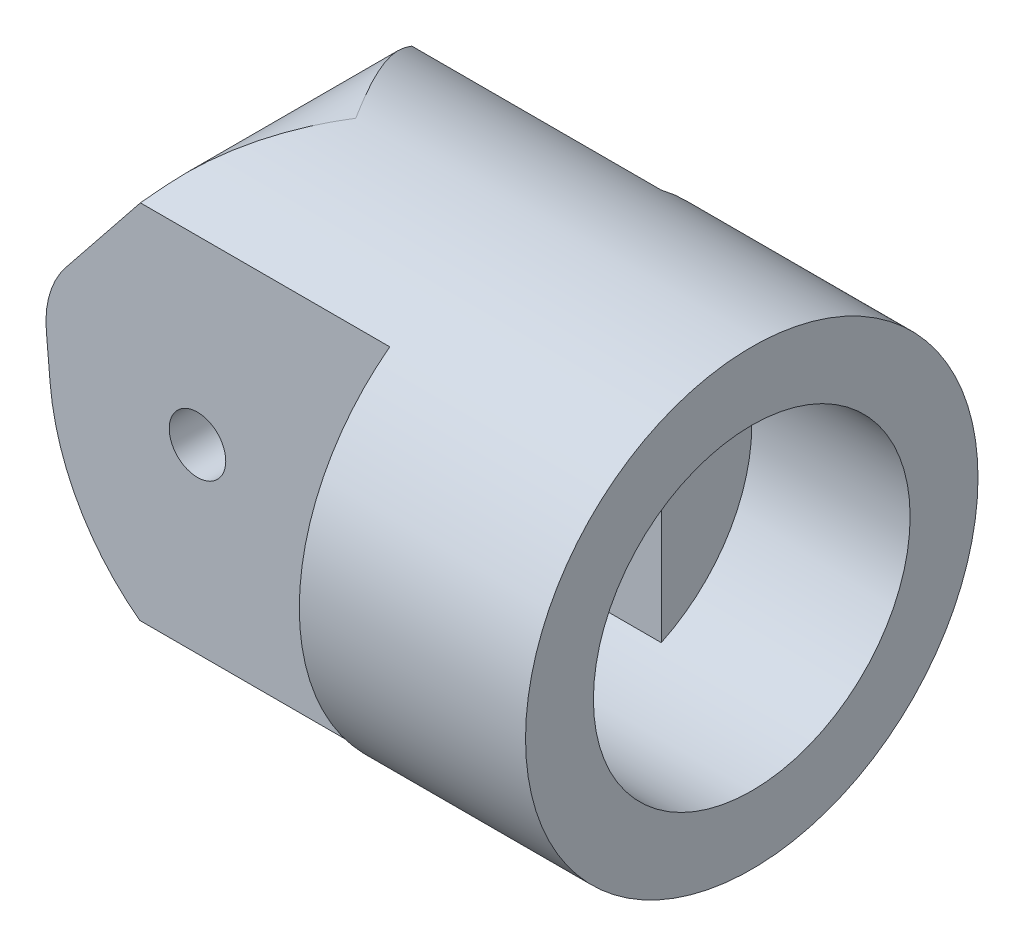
ISO-10303-21;
HEADER;
FILE_DESCRIPTION(('STEP AP214'),'2;1');
FILE_NAME('part.step','',(''),(''),'','','');
FILE_SCHEMA(('AUTOMOTIVE_DESIGN { 1 0 10303 214 1 1 1 1 }'));
ENDSEC;
DATA;
#1=APPLICATION_CONTEXT('core data for automotive mechanical design processes');
#2=APPLICATION_PROTOCOL_DEFINITION('international standard','automotive_design',2000,#1);
#3=PRODUCT_CONTEXT('',#1,'mechanical');
#4=PRODUCT('Part','Part','',(#3));
#5=PRODUCT_RELATED_PRODUCT_CATEGORY('part','',(#4));
#6=PRODUCT_DEFINITION_FORMATION('','',#4);
#7=PRODUCT_DEFINITION_CONTEXT('part definition',#1,'design');
#8=PRODUCT_DEFINITION('design','',#6,#7);
#9=PRODUCT_DEFINITION_SHAPE('','',#8);
#10=(LENGTH_UNIT() NAMED_UNIT(*) SI_UNIT(.MILLI.,.METRE.));
#11=(NAMED_UNIT(*) PLANE_ANGLE_UNIT() SI_UNIT($,.RADIAN.));
#12=(NAMED_UNIT(*) SI_UNIT($,.STERADIAN.) SOLID_ANGLE_UNIT());
#13=UNCERTAINTY_MEASURE_WITH_UNIT(LENGTH_MEASURE(1.E-05),#10,'distance_accuracy_value','');
#14=(GEOMETRIC_REPRESENTATION_CONTEXT(3) GLOBAL_UNCERTAINTY_ASSIGNED_CONTEXT((#13)) GLOBAL_UNIT_ASSIGNED_CONTEXT((#10,
#11,#12)) REPRESENTATION_CONTEXT('',''));
#15=CARTESIAN_POINT('',(0.,0.,0.));
#16=DIRECTION('',(0.,0.,1.));
#17=DIRECTION('',(1.,0.,0.));
#18=AXIS2_PLACEMENT_3D('',#15,#16,#17);
#19=CARTESIAN_POINT('',(-7.,0.,0.));
#20=DIRECTION('',(1.,0.,0.));
#21=DIRECTION('',(0.,0.,-1.));
#22=AXIS2_PLACEMENT_3D('',#19,#20,#21);
#23=PLANE('',#22);
#24=DIRECTION('',(0.,-1.,0.));
#25=VECTOR('',#24,1.);
#26=CARTESIAN_POINT('',(-7.,0.,3.));
#27=LINE('',#26,#25);
#28=CARTESIAN_POINT('',(-7.,6.32455532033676,3.));
#29=VERTEX_POINT('',#28);
#30=CARTESIAN_POINT('',(-7.,-6.32455532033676,3.));
#31=VERTEX_POINT('',#30);
#32=EDGE_CURVE('E12',#29,#31,#27,.T.);
#33=ORIENTED_EDGE('',*,*,#32,.F.);
#34=CARTESIAN_POINT('',(-7.,0.,0.));
#35=DIRECTION('',(1.,0.,0.));
#36=DIRECTION('',(0.,0.,-1.));
#37=AXIS2_PLACEMENT_3D('',#34,#35,#36);
#38=CIRCLE('',#37,7.);
#39=EDGE_CURVE('E397',#29,#31,#38,.T.);
#40=ORIENTED_EDGE('',*,*,#39,.T.);
#41=EDGE_LOOP('',(#33,#40));
#42=FACE_BOUND('',#41,.T.);
#43=ADVANCED_FACE('F39',(#42),#23,.T.);
#44=CARTESIAN_POINT('',(-18.5,0.,-10.));
#45=DIRECTION('',(0.,0.,1.));
#46=DIRECTION('',(1.,0.,0.));
#47=AXIS2_PLACEMENT_3D('',#44,#45,#46);
#48=CYLINDRICAL_SURFACE('',#47,1.25);
#49=CARTESIAN_POINT('',(-18.5,0.,-3.));
#50=DIRECTION('',(0.,0.,-1.));
#51=DIRECTION('',(0.,1.,0.));
#52=AXIS2_PLACEMENT_3D('',#49,#50,#51);
#53=CIRCLE('',#52,1.25);
#54=CARTESIAN_POINT('',(-18.5,1.25,-3.));
#55=VERTEX_POINT('',#54);
#56=EDGE_CURVE('E213',#55,#55,#53,.F.);
#57=ORIENTED_EDGE('',*,*,#56,.T.);
#58=EDGE_LOOP('',(#57));
#59=FACE_BOUND('',#58,.T.);
#60=CARTESIAN_POINT('',(-18.5,0.,-6.));
#61=DIRECTION('',(0.,0.,1.));
#62=DIRECTION('',(1.,0.,0.));
#63=AXIS2_PLACEMENT_3D('',#60,#61,#62);
#64=CIRCLE('',#63,1.25);
#65=CARTESIAN_POINT('',(-17.25,0.,-6.));
#66=VERTEX_POINT('',#65);
#67=EDGE_CURVE('E253',#66,#66,#64,.T.);
#68=ORIENTED_EDGE('',*,*,#67,.F.);
#69=EDGE_LOOP('',(#68));
#70=FACE_BOUND('',#69,.T.);
#71=ADVANCED_FACE('F318',(#59,#70),#48,.F.);
#72=CARTESIAN_POINT('',(-25.1817611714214,1.0294173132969,-10.));
#73=DIRECTION('',(-0.996194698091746,-0.0871557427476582,0.));
#74=DIRECTION('',(0.0871557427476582,-0.996194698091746,0.));
#75=AXIS2_PLACEMENT_3D('',#72,#73,#74);
#76=PLANE('',#75);
#77=DIRECTION('',(0.087155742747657,-0.996194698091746,0.));
#78=VECTOR('',#77,1.);
#79=CARTESIAN_POINT('',(-25.6814978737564,6.74143395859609,-3.));
#80=LINE('',#79,#78);
#81=CARTESIAN_POINT('',(-25.1817611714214,1.02941731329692,-3.));
#82=VERTEX_POINT('',#81);
#83=CARTESIAN_POINT('',(-25.0154474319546,-0.87155742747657,-3.));
#84=VERTEX_POINT('',#83);
#85=EDGE_CURVE('E387',#82,#84,#80,.T.);
#86=ORIENTED_EDGE('',*,*,#85,.F.);
#87=DIRECTION('',(0.,0.,1.));
#88=VECTOR('',#87,1.);
#89=CARTESIAN_POINT('',(-25.1817611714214,1.0294173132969,-10.));
#90=LINE('',#89,#88);
#91=CARTESIAN_POINT('',(-25.1817611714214,1.0294173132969,-6.));
#92=VERTEX_POINT('',#91);
#93=EDGE_CURVE('E222',#92,#82,#90,.T.);
#94=ORIENTED_EDGE('',*,*,#93,.F.);
#95=DIRECTION('',(0.0871557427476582,-0.996194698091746,0.));
#96=VECTOR('',#95,1.);
#97=CARTESIAN_POINT('',(-24.2303575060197,-9.84517634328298,-6.));
#98=LINE('',#97,#96);
#99=CARTESIAN_POINT('',(-25.0154474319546,-0.871557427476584,-6.));
#100=VERTEX_POINT('',#99);
#101=EDGE_CURVE('E285',#92,#100,#98,.T.);
#102=ORIENTED_EDGE('',*,*,#101,.T.);
#103=DIRECTION('',(0.,0.,1.));
#104=VECTOR('',#103,1.);
#105=CARTESIAN_POINT('',(-25.0154474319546,-0.871557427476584,-10.));
#106=LINE('',#105,#104);
#107=EDGE_CURVE('E217',#100,#84,#106,.T.);
#108=ORIENTED_EDGE('',*,*,#107,.T.);
#109=EDGE_LOOP('',(#86,#94,#102,#108));
#110=FACE_BOUND('',#109,.T.);
#111=ADVANCED_FACE('F346',(#110),#76,.T.);
#112=CARTESIAN_POINT('',(-21.1969823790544,1.37804028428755,-10.));
#113=DIRECTION('',(0.,0.,1.));
#114=DIRECTION('',(1.,0.,0.));
#115=AXIS2_PLACEMENT_3D('',#112,#113,#114);
#116=CYLINDRICAL_SURFACE('',#115,4.);
#117=CARTESIAN_POINT('',(-21.1969823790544,1.37804028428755,-3.));
#118=DIRECTION('',(0.,0.,-1.));
#119=DIRECTION('',(0.,1.,0.));
#120=AXIS2_PLACEMENT_3D('',#117,#118,#119);
#121=CIRCLE('',#120,4.);
#122=CARTESIAN_POINT('',(-24.3210892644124,3.87603071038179,-3.));
#123=VERTEX_POINT('',#122);
#124=EDGE_CURVE('E210',#123,#82,#121,.F.);
#125=ORIENTED_EDGE('',*,*,#124,.F.);
#126=DIRECTION('',(0.,0.,1.));
#127=VECTOR('',#126,1.);
#128=CARTESIAN_POINT('',(-24.3210892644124,3.87603071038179,-10.));
#129=LINE('',#128,#127);
#130=CARTESIAN_POINT('',(-24.3210892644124,3.87603071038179,-6.));
#131=VERTEX_POINT('',#130);
#132=EDGE_CURVE('E226',#131,#123,#129,.T.);
#133=ORIENTED_EDGE('',*,*,#132,.F.);
#134=CARTESIAN_POINT('',(-21.1969823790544,1.37804028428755,-6.));
#135=DIRECTION('',(0.,0.,1.));
#136=DIRECTION('',(1.,0.,0.));
#137=AXIS2_PLACEMENT_3D('',#134,#135,#136);
#138=CIRCLE('',#137,4.);
#139=EDGE_CURVE('E283',#131,#92,#138,.T.);
#140=ORIENTED_EDGE('',*,*,#139,.T.);
#141=ORIENTED_EDGE('',*,*,#93,.T.);
#142=EDGE_LOOP('',(#125,#133,#140,#141));
#143=FACE_BOUND('',#142,.T.);
#144=ADVANCED_FACE('F335',(#143),#116,.T.);
#145=CARTESIAN_POINT('',(-26.,0.,0.));
#146=DIRECTION('',(1.,0.,0.));
#147=DIRECTION('',(0.,0.,-1.));
#148=AXIS2_PLACEMENT_3D('',#145,#146,#147);
#149=CYLINDRICAL_SURFACE('',#148,10.);
#150=CARTESIAN_POINT('',(0.,0.,0.));
#151=DIRECTION('',(-1.,0.,0.));
#152=DIRECTION('',(0.,0.,1.));
#153=AXIS2_PLACEMENT_3D('',#150,#151,#152);
#154=CIRCLE('',#153,10.);
#155=CARTESIAN_POINT('',(0.,0.,10.));
#156=VERTEX_POINT('',#155);
#157=EDGE_CURVE('E392',#156,#156,#154,.T.);
#158=ORIENTED_EDGE('',*,*,#157,.T.);
#159=EDGE_LOOP('',(#158));
#160=FACE_BOUND('',#159,.T.);
#161=CARTESIAN_POINT('',(-20.6254375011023,8.49799042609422,-5.27106808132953));
#162=CARTESIAN_POINT('',(-20.5671299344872,8.57090207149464,-5.15351552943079));
#163=CARTESIAN_POINT('',(-20.5069495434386,8.64094458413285,-5.03515302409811));
#164=CARTESIAN_POINT('',(-20.383270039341,8.775387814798,-4.79700674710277));
#165=CARTESIAN_POINT('',(-20.3197716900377,8.83978982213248,-4.67722330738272));
#166=CARTESIAN_POINT('',(-20.125051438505,9.02458249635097,-4.31624190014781));
#167=CARTESIAN_POINT('',(-19.9894649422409,9.13673112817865,-4.0731349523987));
#168=CARTESIAN_POINT('',(-19.7099064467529,9.33944937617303,-3.58393723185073));
#169=CARTESIAN_POINT('',(-19.5659598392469,9.4300804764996,-3.33785712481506));
#170=CARTESIAN_POINT('',(-19.2715161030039,9.59090208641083,-2.84293751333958));
#171=CARTESIAN_POINT('',(-19.1210178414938,9.66108904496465,-2.59409753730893));
#172=CARTESIAN_POINT('',(-18.7326227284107,9.81419386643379,-1.95922729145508));
#173=CARTESIAN_POINT('',(-18.4915045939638,9.88344555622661,-1.57183121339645));
#174=CARTESIAN_POINT('',(-18.004219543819,9.97599229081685,-0.795177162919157));
#175=CARTESIAN_POINT('',(-17.7580573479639,9.99932847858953,-0.405921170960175));
#176=CARTESIAN_POINT('',(-17.5084575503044,9.99999523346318,-0.0112686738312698));
#177=CARTESIAN_POINT('',(-17.5048940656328,9.99999999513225,-0.00563430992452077));
#178=CARTESIAN_POINT('',(-17.5013306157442,10.,0.));
#179=B_SPLINE_CURVE_WITH_KNOTS('',3,(#161,#162,#163,#164,#165,#166,#167,#168,#169,#170,#171,
#172,#173,#174,#175,#176,#177,#178),.UNSPECIFIED.,.F.,.F.,(4,2,2,2,2,2,2,2,4),(0.,
0.450248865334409,0.900394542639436,1.79962462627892,2.69625346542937,3.59303795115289,
4.97514175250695,6.35600654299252,6.37600654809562),.UNSPECIFIED.);
#180=CARTESIAN_POINT('',(-20.6254375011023,8.49799042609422,-5.27106808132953));
#181=VERTEX_POINT('',#180);
#182=CARTESIAN_POINT('',(-17.5013306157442,10.,0.));
#183=VERTEX_POINT('',#182);
#184=EDGE_CURVE('E289',#181,#183,#179,.T.);
#185=ORIENTED_EDGE('',*,*,#184,.T.);
#186=CARTESIAN_POINT('',(-20.6254375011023,8.49799042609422,5.27106808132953));
#187=CARTESIAN_POINT('',(-20.5671299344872,8.57090207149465,5.15351552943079));
#188=CARTESIAN_POINT('',(-20.5069495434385,8.64094458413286,5.03515302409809));
#189=CARTESIAN_POINT('',(-20.383270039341,8.77538781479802,4.79700674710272));
#190=CARTESIAN_POINT('',(-20.3197716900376,8.83978982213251,4.67722330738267));
#191=CARTESIAN_POINT('',(-20.125051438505,9.02458249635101,4.31624190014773));
#192=CARTESIAN_POINT('',(-19.9894649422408,9.1367311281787,4.07313495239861));
#193=CARTESIAN_POINT('',(-19.7099064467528,9.33944937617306,3.58393723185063));
#194=CARTESIAN_POINT('',(-19.5659598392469,9.43008047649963,3.33785712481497));
#195=CARTESIAN_POINT('',(-19.2715161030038,9.59090208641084,2.84293751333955));
#196=CARTESIAN_POINT('',(-19.1210178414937,9.66108904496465,2.59409753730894));
#197=CARTESIAN_POINT('',(-18.7326227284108,9.81419386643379,1.95922729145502));
#198=CARTESIAN_POINT('',(-18.4915045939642,9.88344555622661,1.57183121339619));
#199=CARTESIAN_POINT('',(-18.0042195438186,9.97599229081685,0.795177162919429));
#200=CARTESIAN_POINT('',(-17.7580573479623,9.99932847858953,0.405921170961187));
#201=CARTESIAN_POINT('',(-17.5084575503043,9.99999523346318,0.0112686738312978));
#202=CARTESIAN_POINT('',(-17.5048940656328,9.99999999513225,0.00563430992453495));
#203=CARTESIAN_POINT('',(-17.5013306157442,10.,0.));
#204=B_SPLINE_CURVE_WITH_KNOTS('',3,(#186,#187,#188,#189,#190,#191,#192,#193,#194,#195,#196,
#197,#198,#199,#200,#201,#202,#203),.UNSPECIFIED.,.F.,.F.,(4,2,2,2,2,2,2,2,4),(0.,
0.450248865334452,0.900394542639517,1.79962462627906,2.69625346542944,3.59303795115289,
4.97514175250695,6.35600654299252,6.37600654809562),.UNSPECIFIED.);
#205=CARTESIAN_POINT('',(-20.6254375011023,8.49799042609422,5.27106808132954));
#206=VERTEX_POINT('',#205);
#207=EDGE_CURVE('E296',#183,#206,#204,.F.);
#208=ORIENTED_EDGE('',*,*,#207,.T.);
#209=CARTESIAN_POINT('',(-27.4203070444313,0.,0.));
#210=DIRECTION('',(-0.781026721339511,0.624497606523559,0.));
#211=DIRECTION('',(0.624497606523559,0.781026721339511,0.));
#212=AXIS2_PLACEMENT_3D('',#209,#210,#211);
#213=ELLIPSE('',#212,12.8036592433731,10.);
#214=CARTESIAN_POINT('',(-21.0236234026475,8.,6.));
#215=VERTEX_POINT('',#214);
#216=EDGE_CURVE('E235',#206,#215,#213,.F.);
#217=ORIENTED_EDGE('',*,*,#216,.T.);
#218=DIRECTION('',(1.,0.,0.));
#219=VECTOR('',#218,1.);
#220=CARTESIAN_POINT('',(-26.,8.,6.));
#221=LINE('',#220,#219);
#222=CARTESIAN_POINT('',(-10.,8.,6.));
#223=VERTEX_POINT('',#222);
#224=EDGE_CURVE('E268',#215,#223,#221,.T.);
#225=ORIENTED_EDGE('',*,*,#224,.T.);
#226=CARTESIAN_POINT('',(-9.99999999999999,0.,0.));
#227=DIRECTION('',(1.,0.,0.));
#228=DIRECTION('',(0.,0.,-1.));
#229=AXIS2_PLACEMENT_3D('',#226,#227,#228);
#230=CIRCLE('',#229,10.);
#231=CARTESIAN_POINT('',(-10.,-8.,6.));
#232=VERTEX_POINT('',#231);
#233=EDGE_CURVE('E273',#232,#223,#230,.F.);
#234=ORIENTED_EDGE('',*,*,#233,.F.);
#235=DIRECTION('',(1.,0.,0.));
#236=VECTOR('',#235,1.);
#237=CARTESIAN_POINT('',(-26.,-8.,6.));
#238=LINE('',#237,#236);
#239=CARTESIAN_POINT('',(-21.0535004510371,-8.,6.));
#240=VERTEX_POINT('',#239);
#241=EDGE_CURVE('E270',#232,#240,#238,.F.);
#242=ORIENTED_EDGE('',*,*,#241,.T.);
#243=CARTESIAN_POINT('',(-15.0535004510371,0.,0.));
#244=DIRECTION('',(0.707106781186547,0.,0.707106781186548));
#245=DIRECTION('',(0.707106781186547,0.,-0.707106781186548));
#246=AXIS2_PLACEMENT_3D('',#243,#244,#245);
#247=ELLIPSE('',#246,14.142135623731,10.);
#248=CARTESIAN_POINT('',(-15.0535004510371,-10.,0.));
#249=VERTEX_POINT('',#248);
#250=EDGE_CURVE('E247',#240,#249,#247,.T.);
#251=ORIENTED_EDGE('',*,*,#250,.T.);
#252=CARTESIAN_POINT('',(-15.0535004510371,0.,0.));
#253=DIRECTION('',(0.707106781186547,0.,-0.707106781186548));
#254=DIRECTION('',(0.707106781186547,0.,0.707106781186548));
#255=AXIS2_PLACEMENT_3D('',#252,#253,#254);
#256=ELLIPSE('',#255,14.142135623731,10.);
#257=CARTESIAN_POINT('',(-21.0535004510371,-7.99999999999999,-6.));
#258=VERTEX_POINT('',#257);
#259=EDGE_CURVE('E244',#249,#258,#256,.T.);
#260=ORIENTED_EDGE('',*,*,#259,.T.);
#261=DIRECTION('',(1.,0.,0.));
#262=VECTOR('',#261,1.);
#263=CARTESIAN_POINT('',(-26.,-8.,-6.));
#264=LINE('',#263,#262);
#265=CARTESIAN_POINT('',(-9.99999999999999,-8.,-6.));
#266=VERTEX_POINT('',#265);
#267=EDGE_CURVE('E262',#266,#258,#264,.F.);
#268=ORIENTED_EDGE('',*,*,#267,.F.);
#269=CARTESIAN_POINT('',(-9.99999999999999,0.,0.));
#270=DIRECTION('',(-1.,0.,0.));
#271=DIRECTION('',(0.,0.,1.));
#272=AXIS2_PLACEMENT_3D('',#269,#270,#271);
#273=CIRCLE('',#272,10.);
#274=CARTESIAN_POINT('',(-9.99999999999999,8.,-6.));
#275=VERTEX_POINT('',#274);
#276=EDGE_CURVE('E276',#266,#275,#273,.F.);
#277=ORIENTED_EDGE('',*,*,#276,.T.);
#278=DIRECTION('',(1.,0.,0.));
#279=VECTOR('',#278,1.);
#280=CARTESIAN_POINT('',(-26.,8.,-6.));
#281=LINE('',#280,#279);
#282=CARTESIAN_POINT('',(-21.0236234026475,8.,-6.));
#283=VERTEX_POINT('',#282);
#284=EDGE_CURVE('E260',#283,#275,#281,.T.);
#285=ORIENTED_EDGE('',*,*,#284,.F.);
#286=EDGE_CURVE('E220',#283,#181,#213,.F.);
#287=ORIENTED_EDGE('',*,*,#286,.T.);
#288=EDGE_LOOP('',(#185,#208,#217,#225,#234,#242,#251,#260,#268,#277,#285,#287));
#289=FACE_BOUND('',#288,.T.);
#290=ADVANCED_FACE('F41',(#160,#289),#149,.T.);
#291=CARTESIAN_POINT('',(-26.,-10.,6.));
#292=DIRECTION('',(0.,0.,1.));
#293=DIRECTION('',(1.,0.,0.));
#294=AXIS2_PLACEMENT_3D('',#291,#292,#293);
#295=PLANE('',#294);
#296=CARTESIAN_POINT('',(-18.5,0.,6.));
#297=DIRECTION('',(0.,0.,1.));
#298=DIRECTION('',(1.,0.,0.));
#299=AXIS2_PLACEMENT_3D('',#296,#297,#298);
#300=CIRCLE('',#299,1.25);
#301=CARTESIAN_POINT('',(-17.25,0.,6.));
#302=VERTEX_POINT('',#301);
#303=EDGE_CURVE('E254',#302,#302,#300,.T.);
#304=ORIENTED_EDGE('',*,*,#303,.F.);
#305=EDGE_LOOP('',(#304));
#306=FACE_BOUND('',#305,.T.);
#307=DIRECTION('',(0.0871557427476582,-0.996194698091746,0.));
#308=VECTOR('',#307,1.);
#309=CARTESIAN_POINT('',(-24.2303575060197,-9.84517634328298,6.));
#310=LINE('',#309,#308);
#311=CARTESIAN_POINT('',(-25.1817611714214,1.0294173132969,6.));
#312=VERTEX_POINT('',#311);
#313=CARTESIAN_POINT('',(-25.0154474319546,-0.871557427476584,6.));
#314=VERTEX_POINT('',#313);
#315=EDGE_CURVE('E241',#312,#314,#310,.T.);
#316=ORIENTED_EDGE('',*,*,#315,.T.);
#317=CARTESIAN_POINT('',(-15.0535004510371,0.,6.));
#318=DIRECTION('',(0.,0.,1.));
#319=DIRECTION('',(1.,0.,0.));
#320=AXIS2_PLACEMENT_3D('',#317,#318,#319);
#321=CIRCLE('',#320,10.);
#322=EDGE_CURVE('E250',#314,#240,#321,.T.);
#323=ORIENTED_EDGE('',*,*,#322,.T.);
#324=ORIENTED_EDGE('',*,*,#241,.F.);
#325=DIRECTION('',(0.,1.,0.));
#326=VECTOR('',#325,1.);
#327=CARTESIAN_POINT('',(-9.99999999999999,-10.,6.));
#328=LINE('',#327,#326);
#329=EDGE_CURVE('E265',#232,#223,#328,.T.);
#330=ORIENTED_EDGE('',*,*,#329,.T.);
#331=ORIENTED_EDGE('',*,*,#224,.F.);
#332=DIRECTION('',(-0.624497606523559,-0.781026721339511,0.));
#333=VECTOR('',#332,1.);
#334=CARTESIAN_POINT('',(-31.7438843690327,-5.40727360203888,6.));
#335=LINE('',#334,#333);
#336=CARTESIAN_POINT('',(-24.3210892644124,3.87603071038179,6.));
#337=VERTEX_POINT('',#336);
#338=EDGE_CURVE('E234',#215,#337,#335,.T.);
#339=ORIENTED_EDGE('',*,*,#338,.T.);
#340=CARTESIAN_POINT('',(-21.1969823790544,1.37804028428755,6.));
#341=DIRECTION('',(0.,0.,1.));
#342=DIRECTION('',(1.,0.,0.));
#343=AXIS2_PLACEMENT_3D('',#340,#341,#342);
#344=CIRCLE('',#343,4.);
#345=EDGE_CURVE('E238',#337,#312,#344,.T.);
#346=ORIENTED_EDGE('',*,*,#345,.T.);
#347=EDGE_LOOP('',(#316,#323,#324,#330,#331,#339,#346));
#348=FACE_BOUND('',#347,.T.);
#349=ADVANCED_FACE('F326',(#306,#348),#295,.T.);
#350=CARTESIAN_POINT('',(-26.,-10.,-6.));
#351=DIRECTION('',(0.,0.,1.));
#352=DIRECTION('',(1.,0.,0.));
#353=AXIS2_PLACEMENT_3D('',#350,#351,#352);
#354=PLANE('',#353);
#355=ORIENTED_EDGE('',*,*,#67,.T.);
#356=EDGE_LOOP('',(#355));
#357=FACE_BOUND('',#356,.T.);
#358=CARTESIAN_POINT('',(-15.0535004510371,0.,-6.));
#359=DIRECTION('',(0.,0.,1.));
#360=DIRECTION('',(1.,0.,0.));
#361=AXIS2_PLACEMENT_3D('',#358,#359,#360);
#362=CIRCLE('',#361,10.);
#363=EDGE_CURVE('E287',#100,#258,#362,.T.);
#364=ORIENTED_EDGE('',*,*,#363,.F.);
#365=ORIENTED_EDGE('',*,*,#101,.F.);
#366=ORIENTED_EDGE('',*,*,#139,.F.);
#367=DIRECTION('',(-0.624497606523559,-0.781026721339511,0.));
#368=VECTOR('',#367,1.);
#369=CARTESIAN_POINT('',(-31.7438843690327,-5.40727360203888,-6.));
#370=LINE('',#369,#368);
#371=EDGE_CURVE('E279',#283,#131,#370,.T.);
#372=ORIENTED_EDGE('',*,*,#371,.F.);
#373=ORIENTED_EDGE('',*,*,#284,.T.);
#374=DIRECTION('',(0.,1.,0.));
#375=VECTOR('',#374,1.);
#376=CARTESIAN_POINT('',(-9.99999999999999,-10.,-6.));
#377=LINE('',#376,#375);
#378=EDGE_CURVE('E257',#266,#275,#377,.T.);
#379=ORIENTED_EDGE('',*,*,#378,.F.);
#380=ORIENTED_EDGE('',*,*,#267,.T.);
#381=EDGE_LOOP('',(#364,#365,#366,#372,#373,#379,#380));
#382=FACE_BOUND('',#381,.T.);
#383=ADVANCED_FACE('F323',(#357,#382),#354,.F.);
#384=CARTESIAN_POINT('',(-10.,-10.,10.));
#385=DIRECTION('',(1.,0.,0.));
#386=DIRECTION('',(0.,0.,-1.));
#387=AXIS2_PLACEMENT_3D('',#384,#385,#386);
#388=PLANE('',#387);
#389=ORIENTED_EDGE('',*,*,#329,.F.);
#390=ORIENTED_EDGE('',*,*,#233,.T.);
#391=EDGE_LOOP('',(#389,#390));
#392=FACE_BOUND('',#391,.T.);
#393=ADVANCED_FACE('F321',(#392),#388,.F.);
#394=CARTESIAN_POINT('',(-10.,-10.,-10.));
#395=DIRECTION('',(-1.,0.,0.));
#396=DIRECTION('',(0.,0.,1.));
#397=AXIS2_PLACEMENT_3D('',#394,#395,#396);
#398=PLANE('',#397);
#399=ORIENTED_EDGE('',*,*,#378,.T.);
#400=ORIENTED_EDGE('',*,*,#276,.F.);
#401=EDGE_LOOP('',(#399,#400));
#402=FACE_BOUND('',#401,.T.);
#403=ADVANCED_FACE('F316',(#402),#398,.T.);
#404=CARTESIAN_POINT('',(-18.5,0.,3.));
#405=DIRECTION('',(0.,0.,1.));
#406=DIRECTION('',(0.,-1.,0.));
#407=AXIS2_PLACEMENT_3D('',#404,#405,#406);
#408=CIRCLE('',#407,1.25);
#409=CARTESIAN_POINT('',(-18.5,-1.25,3.));
#410=VERTEX_POINT('',#409);
#411=EDGE_CURVE('E207',#410,#410,#408,.F.);
#412=ORIENTED_EDGE('',*,*,#411,.T.);
#413=EDGE_LOOP('',(#412));
#414=FACE_BOUND('',#413,.T.);
#415=ORIENTED_EDGE('',*,*,#303,.T.);
#416=EDGE_LOOP('',(#415));
#417=FACE_BOUND('',#416,.T.);
#418=ADVANCED_FACE('F311',(#414,#417),#48,.F.);
#419=DIRECTION('',(-0.087155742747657,0.996194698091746,0.));
#420=VECTOR('',#419,1.);
#421=CARTESIAN_POINT('',(-25.6814978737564,6.74143395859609,3.));
#422=LINE('',#421,#420);
#423=CARTESIAN_POINT('',(-25.0154474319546,-0.87155742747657,3.));
#424=VERTEX_POINT('',#423);
#425=CARTESIAN_POINT('',(-25.1817611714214,1.02941731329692,3.));
#426=VERTEX_POINT('',#425);
#427=EDGE_CURVE('E391',#424,#426,#422,.T.);
#428=ORIENTED_EDGE('',*,*,#427,.F.);
#429=EDGE_CURVE('E221',#424,#314,#106,.T.);
#430=ORIENTED_EDGE('',*,*,#429,.T.);
#431=ORIENTED_EDGE('',*,*,#315,.F.);
#432=EDGE_CURVE('E225',#426,#312,#90,.T.);
#433=ORIENTED_EDGE('',*,*,#432,.F.);
#434=EDGE_LOOP('',(#428,#430,#431,#433));
#435=FACE_BOUND('',#434,.T.);
#436=ADVANCED_FACE('F315',(#435),#76,.T.);
#437=CARTESIAN_POINT('',(-21.1969823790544,1.37804028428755,3.));
#438=DIRECTION('',(0.,0.,1.));
#439=DIRECTION('',(0.,-1.,0.));
#440=AXIS2_PLACEMENT_3D('',#437,#438,#439);
#441=CIRCLE('',#440,4.);
#442=CARTESIAN_POINT('',(-24.3210892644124,3.87603071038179,3.));
#443=VERTEX_POINT('',#442);
#444=EDGE_CURVE('E202',#426,#443,#441,.F.);
#445=ORIENTED_EDGE('',*,*,#444,.F.);
#446=ORIENTED_EDGE('',*,*,#432,.T.);
#447=ORIENTED_EDGE('',*,*,#345,.F.);
#448=EDGE_CURVE('E229',#443,#337,#129,.T.);
#449=ORIENTED_EDGE('',*,*,#448,.F.);
#450=EDGE_LOOP('',(#445,#446,#447,#449));
#451=FACE_BOUND('',#450,.T.);
#452=ADVANCED_FACE('F307',(#451),#116,.T.);
#453=CARTESIAN_POINT('',(-17.5013306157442,6.,-10.));
#454=DIRECTION('',(0.,0.,1.));
#455=DIRECTION('',(1.,0.,0.));
#456=AXIS2_PLACEMENT_3D('',#453,#454,#455);
#457=CYLINDRICAL_SURFACE('',#456,4.);
#458=DIRECTION('',(0.,0.,1.));
#459=VECTOR('',#458,1.);
#460=CARTESIAN_POINT('',(-20.6254375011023,8.49799042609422,-10.));
#461=LINE('',#460,#459);
#462=EDGE_CURVE('E216',#181,#206,#461,.T.);
#463=ORIENTED_EDGE('',*,*,#462,.T.);
#464=ORIENTED_EDGE('',*,*,#207,.F.);
#465=ORIENTED_EDGE('',*,*,#184,.F.);
#466=EDGE_LOOP('',(#463,#464,#465));
#467=FACE_BOUND('',#466,.T.);
#468=ADVANCED_FACE('F301',(#467),#457,.T.);
#469=CARTESIAN_POINT('',(-15.0535004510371,0.,-10.));
#470=DIRECTION('',(0.,0.,1.));
#471=DIRECTION('',(1.,0.,0.));
#472=AXIS2_PLACEMENT_3D('',#469,#470,#471);
#473=CYLINDRICAL_SURFACE('',#472,10.);
#474=CARTESIAN_POINT('',(-15.0535004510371,0.,-3.));
#475=DIRECTION('',(0.,0.,-1.));
#476=DIRECTION('',(0.,1.,0.));
#477=AXIS2_PLACEMENT_3D('',#474,#475,#476);
#478=CIRCLE('',#477,10.);
#479=CARTESIAN_POINT('',(-22.1885964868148,-7.0064544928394,-3.));
#480=VERTEX_POINT('',#479);
#481=EDGE_CURVE('E192',#84,#480,#478,.F.);
#482=ORIENTED_EDGE('',*,*,#481,.F.);
#483=ORIENTED_EDGE('',*,*,#107,.F.);
#484=ORIENTED_EDGE('',*,*,#363,.T.);
#485=ORIENTED_EDGE('',*,*,#259,.F.);
#486=ORIENTED_EDGE('',*,*,#250,.F.);
#487=ORIENTED_EDGE('',*,*,#322,.F.);
#488=ORIENTED_EDGE('',*,*,#429,.F.);
#489=CARTESIAN_POINT('',(-15.0535004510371,0.,3.));
#490=DIRECTION('',(0.,0.,1.));
#491=DIRECTION('',(0.,-1.,0.));
#492=AXIS2_PLACEMENT_3D('',#489,#490,#491);
#493=CIRCLE('',#492,10.);
#494=CARTESIAN_POINT('',(-22.1885964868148,-7.0064544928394,3.));
#495=VERTEX_POINT('',#494);
#496=EDGE_CURVE('E204',#495,#424,#493,.F.);
#497=ORIENTED_EDGE('',*,*,#496,.F.);
#498=DIRECTION('',(0.,0.,1.));
#499=VECTOR('',#498,1.);
#500=CARTESIAN_POINT('',(-22.1885964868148,-7.0064544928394,-10.));
#501=LINE('',#500,#499);
#502=EDGE_CURVE('E356',#480,#495,#501,.T.);
#503=ORIENTED_EDGE('',*,*,#502,.F.);
#504=EDGE_LOOP('',(#482,#483,#484,#485,#486,#487,#488,#497,#503));
#505=FACE_BOUND('',#504,.T.);
#506=ADVANCED_FACE('F306',(#505),#473,.T.);
#507=CARTESIAN_POINT('',(-24.3210892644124,3.87603071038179,-10.));
#508=DIRECTION('',(-0.781026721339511,0.624497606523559,0.));
#509=DIRECTION('',(-0.624497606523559,-0.781026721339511,0.));
#510=AXIS2_PLACEMENT_3D('',#507,#508,#509);
#511=PLANE('',#510);
#512=DIRECTION('',(-0.624497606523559,-0.781026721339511,0.));
#513=VECTOR('',#512,1.);
#514=CARTESIAN_POINT('',(-24.3210892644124,3.87603071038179,-3.));
#515=LINE('',#514,#513);
#516=CARTESIAN_POINT('',(-21.755298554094,7.08493188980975,-3.));
#517=VERTEX_POINT('',#516);
#518=EDGE_CURVE('E357',#517,#123,#515,.T.);
#519=ORIENTED_EDGE('',*,*,#518,.F.);
#520=DIRECTION('',(0.,0.,-1.));
#521=VECTOR('',#520,1.);
#522=CARTESIAN_POINT('',(-21.755298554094,7.08493188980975,-10.));
#523=LINE('',#522,#521);
#524=CARTESIAN_POINT('',(-21.755298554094,7.08493188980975,3.));
#525=VERTEX_POINT('',#524);
#526=EDGE_CURVE('E361',#525,#517,#523,.T.);
#527=ORIENTED_EDGE('',*,*,#526,.F.);
#528=DIRECTION('',(0.624497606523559,0.781026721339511,0.));
#529=VECTOR('',#528,1.);
#530=CARTESIAN_POINT('',(-24.3210892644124,3.87603071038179,3.));
#531=LINE('',#530,#529);
#532=EDGE_CURVE('E362',#443,#525,#531,.T.);
#533=ORIENTED_EDGE('',*,*,#532,.F.);
#534=ORIENTED_EDGE('',*,*,#448,.T.);
#535=ORIENTED_EDGE('',*,*,#338,.F.);
#536=ORIENTED_EDGE('',*,*,#216,.F.);
#537=ORIENTED_EDGE('',*,*,#462,.F.);
#538=ORIENTED_EDGE('',*,*,#286,.F.);
#539=ORIENTED_EDGE('',*,*,#371,.T.);
#540=ORIENTED_EDGE('',*,*,#132,.T.);
#541=EDGE_LOOP('',(#519,#527,#533,#534,#535,#536,#537,#538,#539,#540));
#542=FACE_BOUND('',#541,.T.);
#543=ADVANCED_FACE('F309',(#542),#511,.T.);
#544=CARTESIAN_POINT('',(-13.7271614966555,7.78730287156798,-3.));
#545=DIRECTION('',(0.,0.,-1.));
#546=DIRECTION('',(0.,1.,0.));
#547=AXIS2_PLACEMENT_3D('',#544,#545,#546);
#548=PLANE('',#547);
#549=ORIENTED_EDGE('',*,*,#518,.T.);
#550=ORIENTED_EDGE('',*,*,#124,.T.);
#551=ORIENTED_EDGE('',*,*,#85,.T.);
#552=ORIENTED_EDGE('',*,*,#481,.T.);
#553=DIRECTION('',(-0.996194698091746,-0.087155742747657,0.));
#554=VECTOR('',#553,1.);
#555=CARTESIAN_POINT('',(-12.5069810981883,-6.15942290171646,-3.));
#556=LINE('',#555,#554);
#557=CARTESIAN_POINT('',(-14.3944532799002,-6.32455532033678,-3.));
#558=VERTEX_POINT('',#557);
#559=EDGE_CURVE('E183',#558,#480,#556,.T.);
#560=ORIENTED_EDGE('',*,*,#559,.F.);
#561=DIRECTION('',(1.,0.,0.));
#562=VECTOR('',#561,1.);
#563=CARTESIAN_POINT('',(-25.1969823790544,-6.32455532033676,-3.));
#564=LINE('',#563,#562);
#565=CARTESIAN_POINT('',(-7.,-6.32455532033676,-3.));
#566=VERTEX_POINT('',#565);
#567=EDGE_CURVE('E61',#558,#566,#564,.T.);
#568=ORIENTED_EDGE('',*,*,#567,.T.);
#569=DIRECTION('',(0.,1.,0.));
#570=VECTOR('',#569,1.);
#571=CARTESIAN_POINT('',(-7.,0.,-3.));
#572=LINE('',#571,#570);
#573=CARTESIAN_POINT('',(-7.,6.32455532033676,-3.));
#574=VERTEX_POINT('',#573);
#575=EDGE_CURVE('E48',#566,#574,#572,.T.);
#576=ORIENTED_EDGE('',*,*,#575,.T.);
#577=DIRECTION('',(1.,0.,0.));
#578=VECTOR('',#577,1.);
#579=CARTESIAN_POINT('',(-25.1969823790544,6.32455532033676,-3.));
#580=LINE('',#579,#578);
#581=CARTESIAN_POINT('',(-13.5991876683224,6.32455532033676,-3.));
#582=VERTEX_POINT('',#581);
#583=EDGE_CURVE('E55',#582,#574,#580,.T.);
#584=ORIENTED_EDGE('',*,*,#583,.F.);
#585=DIRECTION('',(0.087155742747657,-0.996194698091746,0.));
#586=VECTOR('',#585,1.);
#587=CARTESIAN_POINT('',(-13.7271614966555,7.78730287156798,-3.));
#588=LINE('',#587,#586);
#589=CARTESIAN_POINT('',(-13.7271614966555,7.78730287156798,-3.));
#590=VERTEX_POINT('',#589);
#591=EDGE_CURVE('E394',#590,#582,#588,.T.);
#592=ORIENTED_EDGE('',*,*,#591,.F.);
#593=DIRECTION('',(-0.996194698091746,-0.087155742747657,0.));
#594=VECTOR('',#593,1.);
#595=CARTESIAN_POINT('',(-13.7271614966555,7.78730287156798,-3.));
#596=LINE('',#595,#594);
#597=EDGE_CURVE('E205',#590,#517,#596,.T.);
#598=ORIENTED_EDGE('',*,*,#597,.T.);
#599=EDGE_LOOP('',(#549,#550,#551,#552,#560,#568,#576,#584,#592,#598));
#600=FACE_BOUND('',#599,.T.);
#601=ORIENTED_EDGE('',*,*,#56,.F.);
#602=EDGE_LOOP('',(#601));
#603=FACE_BOUND('',#602,.T.);
#604=ADVANCED_FACE('F189',(#600,#603),#548,.F.);
#605=CARTESIAN_POINT('',(-13.7271614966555,7.78730287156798,3.));
#606=DIRECTION('',(0.,0.,1.));
#607=DIRECTION('',(0.,-1.,0.));
#608=AXIS2_PLACEMENT_3D('',#605,#606,#607);
#609=PLANE('',#608);
#610=DIRECTION('',(-0.087155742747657,0.996194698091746,0.));
#611=VECTOR('',#610,1.);
#612=CARTESIAN_POINT('',(-13.7271614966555,7.78730287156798,3.));
#613=LINE('',#612,#611);
#614=CARTESIAN_POINT('',(-13.5991876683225,6.32455532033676,3.));
#615=VERTEX_POINT('',#614);
#616=CARTESIAN_POINT('',(-13.7271614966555,7.78730287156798,3.));
#617=VERTEX_POINT('',#616);
#618=EDGE_CURVE('E198',#615,#617,#613,.T.);
#619=ORIENTED_EDGE('',*,*,#618,.F.);
#620=DIRECTION('',(1.,0.,0.));
#621=VECTOR('',#620,1.);
#622=CARTESIAN_POINT('',(-25.1969823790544,6.32455532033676,3.));
#623=LINE('',#622,#621);
#624=EDGE_CURVE('E632',#615,#29,#623,.T.);
#625=ORIENTED_EDGE('',*,*,#624,.T.);
#626=ORIENTED_EDGE('',*,*,#32,.T.);
#627=DIRECTION('',(1.,0.,0.));
#628=VECTOR('',#627,1.);
#629=CARTESIAN_POINT('',(-25.1969823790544,-6.32455532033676,3.));
#630=LINE('',#629,#628);
#631=CARTESIAN_POINT('',(-14.3944532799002,-6.32455532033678,3.));
#632=VERTEX_POINT('',#631);
#633=EDGE_CURVE('E630',#632,#31,#630,.T.);
#634=ORIENTED_EDGE('',*,*,#633,.F.);
#635=DIRECTION('',(-0.996194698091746,-0.087155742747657,0.));
#636=VECTOR('',#635,1.);
#637=CARTESIAN_POINT('',(-12.5069810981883,-6.15942290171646,3.));
#638=LINE('',#637,#636);
#639=EDGE_CURVE('E185',#632,#495,#638,.T.);
#640=ORIENTED_EDGE('',*,*,#639,.T.);
#641=ORIENTED_EDGE('',*,*,#496,.T.);
#642=ORIENTED_EDGE('',*,*,#427,.T.);
#643=ORIENTED_EDGE('',*,*,#444,.T.);
#644=ORIENTED_EDGE('',*,*,#532,.T.);
#645=DIRECTION('',(-0.996194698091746,-0.087155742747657,0.));
#646=VECTOR('',#645,1.);
#647=CARTESIAN_POINT('',(-13.7271614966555,7.78730287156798,3.));
#648=LINE('',#647,#646);
#649=EDGE_CURVE('E195',#617,#525,#648,.T.);
#650=ORIENTED_EDGE('',*,*,#649,.F.);
#651=EDGE_LOOP('',(#619,#625,#626,#634,#640,#641,#642,#643,#644,#650));
#652=FACE_BOUND('',#651,.T.);
#653=ORIENTED_EDGE('',*,*,#411,.F.);
#654=EDGE_LOOP('',(#653));
#655=FACE_BOUND('',#654,.T.);
#656=ADVANCED_FACE('F419',(#652,#655),#609,.F.);
#657=CARTESIAN_POINT('',(-13.7271614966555,7.78730287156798,-3.));
#658=DIRECTION('',(-0.087155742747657,0.996194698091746,0.));
#659=DIRECTION('',(-0.996194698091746,-0.087155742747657,0.));
#660=AXIS2_PLACEMENT_3D('',#657,#658,#659);
#661=PLANE('',#660);
#662=ORIENTED_EDGE('',*,*,#526,.T.);
#663=ORIENTED_EDGE('',*,*,#597,.F.);
#664=DIRECTION('',(0.,0.,-1.));
#665=VECTOR('',#664,1.);
#666=CARTESIAN_POINT('',(-13.7271614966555,7.78730287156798,-3.));
#667=LINE('',#666,#665);
#668=EDGE_CURVE('E193',#617,#590,#667,.T.);
#669=ORIENTED_EDGE('',*,*,#668,.F.);
#670=ORIENTED_EDGE('',*,*,#649,.T.);
#671=EDGE_LOOP('',(#662,#663,#669,#670));
#672=FACE_BOUND('',#671,.T.);
#673=ADVANCED_FACE('F404',(#672),#661,.F.);
#674=CARTESIAN_POINT('',(-12.5069810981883,-6.15942290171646,-3.));
#675=DIRECTION('',(0.087155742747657,-0.996194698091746,0.));
#676=DIRECTION('',(0.996194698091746,0.087155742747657,0.));
#677=AXIS2_PLACEMENT_3D('',#674,#675,#676);
#678=PLANE('',#677);
#679=ORIENTED_EDGE('',*,*,#639,.F.);
#680=CARTESIAN_POINT('',(57.8955448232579,0.,0.));
#681=DIRECTION('',(0.087155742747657,-0.996194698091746,0.));
#682=DIRECTION('',(0.996194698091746,0.087155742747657,0.));
#683=AXIS2_PLACEMENT_3D('',#680,#681,#682);
#684=ELLIPSE('',#683,80.3159927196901,7.);
#685=EDGE_CURVE('E173',#632,#558,#684,.T.);
#686=ORIENTED_EDGE('',*,*,#685,.T.);
#687=ORIENTED_EDGE('',*,*,#559,.T.);
#688=ORIENTED_EDGE('',*,*,#502,.T.);
#689=EDGE_LOOP('',(#679,#686,#687,#688));
#690=FACE_BOUND('',#689,.T.);
#691=ADVANCED_FACE('F181',(#690),#678,.F.);
#692=CARTESIAN_POINT('',(-12.9467628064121,-1.13269497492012,0.));
#693=DIRECTION('',(-0.996194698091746,-0.087155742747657,0.));
#694=DIRECTION('',(0.087155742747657,-0.996194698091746,0.));
#695=AXIS2_PLACEMENT_3D('',#692,#693,#694);
#696=PLANE('',#695);
#697=CARTESIAN_POINT('',(-13.0458607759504,0.,0.));
#698=DIRECTION('',(-0.996194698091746,-0.087155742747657,0.));
#699=DIRECTION('',(0.087155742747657,-0.996194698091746,0.));
#700=AXIS2_PLACEMENT_3D('',#697,#698,#699);
#701=ELLIPSE('',#700,7.02673886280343,7.);
#702=EDGE_CURVE('E187',#615,#582,#701,.T.);
#703=ORIENTED_EDGE('',*,*,#702,.F.);
#704=ORIENTED_EDGE('',*,*,#618,.T.);
#705=ORIENTED_EDGE('',*,*,#668,.T.);
#706=ORIENTED_EDGE('',*,*,#591,.T.);
#707=EDGE_LOOP('',(#703,#704,#705,#706));
#708=FACE_BOUND('',#707,.T.);
#709=ADVANCED_FACE('F500',(#708),#696,.T.);
#710=CARTESIAN_POINT('',(0.,0.,0.));
#711=DIRECTION('',(-1.,0.,0.));
#712=DIRECTION('',(0.,0.,1.));
#713=AXIS2_PLACEMENT_3D('',#710,#711,#712);
#714=PLANE('',#713);
#715=CARTESIAN_POINT('',(0.,0.,0.));
#716=DIRECTION('',(1.,0.,0.));
#717=DIRECTION('',(0.,0.,-1.));
#718=AXIS2_PLACEMENT_3D('',#715,#716,#717);
#719=CIRCLE('',#718,7.);
#720=CARTESIAN_POINT('',(0.,0.,-7.));
#721=VERTEX_POINT('',#720);
#722=EDGE_CURVE('E186',#721,#721,#719,.T.);
#723=ORIENTED_EDGE('',*,*,#722,.F.);
#724=EDGE_LOOP('',(#723));
#725=FACE_BOUND('',#724,.T.);
#726=ORIENTED_EDGE('',*,*,#157,.F.);
#727=EDGE_LOOP('',(#726));
#728=FACE_BOUND('',#727,.T.);
#729=ADVANCED_FACE('F355',(#725,#728),#714,.F.);
#730=CARTESIAN_POINT('',(-7.,0.,0.));
#731=DIRECTION('',(1.,0.,0.));
#732=DIRECTION('',(0.,0.,-1.));
#733=AXIS2_PLACEMENT_3D('',#730,#731,#732);
#734=CYLINDRICAL_SURFACE('',#733,7.);
#735=ORIENTED_EDGE('',*,*,#633,.T.);
#736=ORIENTED_EDGE('',*,*,#39,.F.);
#737=ORIENTED_EDGE('',*,*,#624,.F.);
#738=ORIENTED_EDGE('',*,*,#702,.T.);
#739=ORIENTED_EDGE('',*,*,#583,.T.);
#740=EDGE_CURVE('E176',#566,#574,#38,.T.);
#741=ORIENTED_EDGE('',*,*,#740,.F.);
#742=ORIENTED_EDGE('',*,*,#567,.F.);
#743=ORIENTED_EDGE('',*,*,#685,.F.);
#744=EDGE_LOOP('',(#735,#736,#737,#738,#739,#741,#742,#743));
#745=FACE_BOUND('',#744,.T.);
#746=ORIENTED_EDGE('',*,*,#722,.T.);
#747=EDGE_LOOP('',(#746));
#748=FACE_BOUND('',#747,.T.);
#749=ADVANCED_FACE('F171',(#745,#748),#734,.F.);
#750=ORIENTED_EDGE('',*,*,#575,.F.);
#751=ORIENTED_EDGE('',*,*,#740,.T.);
#752=EDGE_LOOP('',(#750,#751));
#753=FACE_BOUND('',#752,.T.);
#754=ADVANCED_FACE('F342',(#753),#23,.T.);
#755=CLOSED_SHELL('',(#43,#71,#111,#144,#290,#349,#383,#393,#403,#418,#436,#452,#468,#506,#543,
#604,#656,#673,#691,#709,#729,#749,#754));
#756=MANIFOLD_SOLID_BREP('B2',#755);
#757=ADVANCED_BREP_SHAPE_REPRESENTATION('',(#18,#756),#14);
#758=SHAPE_DEFINITION_REPRESENTATION(#9,#757);
ENDSEC;
END-ISO-10303-21;
